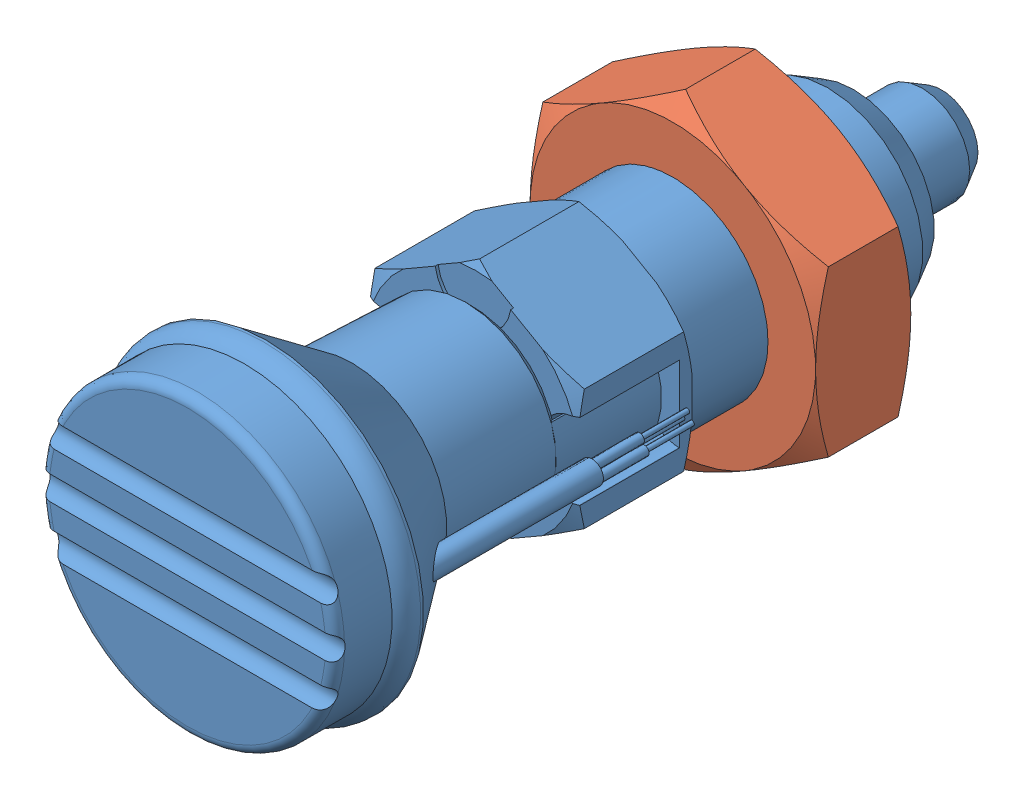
SolidWorks assembly NDX20LW-S.sldasm, configuration Default (file format 15000). Lengths in mm.
Overall size (40.99 40.99 80).
2 component instances, 2 part files, 0 mates.
Components (placement in the parent):
- NDX20LW-S_01-1: NDX20LW-S_01.sldprt [ﾃﾞﾌｫﾙﾄ] at origin size (33 33 80)
- NDX20LW-S_02-1: NDX20LW-S_02.sldprt [ﾃﾞﾌｫﾙﾄ] at origin size (40.99 40.99 10.01)
